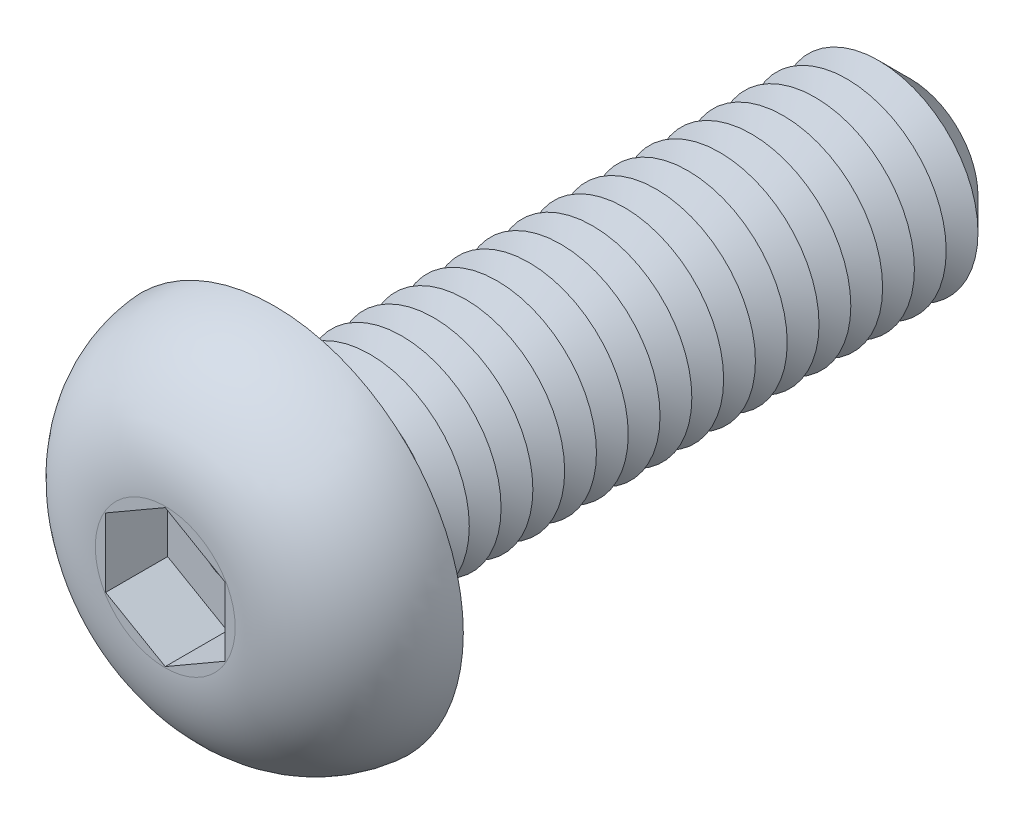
ISO-10303-21;
HEADER;
FILE_DESCRIPTION(('STEP AP214'),'2;1');
FILE_NAME('part.step','',(''),(''),'','','');
FILE_SCHEMA(('AUTOMOTIVE_DESIGN { 1 0 10303 214 1 1 1 1 }'));
ENDSEC;
DATA;
#1=APPLICATION_CONTEXT('core data for automotive mechanical design processes');
#2=APPLICATION_PROTOCOL_DEFINITION('international standard','automotive_design',2000,#1);
#3=PRODUCT_CONTEXT('',#1,'mechanical');
#4=PRODUCT('Part','Part','',(#3));
#5=PRODUCT_RELATED_PRODUCT_CATEGORY('part','',(#4));
#6=PRODUCT_DEFINITION_FORMATION('','',#4);
#7=PRODUCT_DEFINITION_CONTEXT('part definition',#1,'design');
#8=PRODUCT_DEFINITION('design','',#6,#7);
#9=PRODUCT_DEFINITION_SHAPE('','',#8);
#10=(LENGTH_UNIT() NAMED_UNIT(*) SI_UNIT(.MILLI.,.METRE.));
#11=(NAMED_UNIT(*) PLANE_ANGLE_UNIT() SI_UNIT($,.RADIAN.));
#12=(NAMED_UNIT(*) SI_UNIT($,.STERADIAN.) SOLID_ANGLE_UNIT());
#13=UNCERTAINTY_MEASURE_WITH_UNIT(LENGTH_MEASURE(1.E-05),#10,'distance_accuracy_value','');
#14=(GEOMETRIC_REPRESENTATION_CONTEXT(3) GLOBAL_UNCERTAINTY_ASSIGNED_CONTEXT((#13)) GLOBAL_UNIT_ASSIGNED_CONTEXT((#10,
#11,#12)) REPRESENTATION_CONTEXT('',''));
#15=CARTESIAN_POINT('',(0.,0.,0.));
#16=DIRECTION('',(0.,0.,1.));
#17=DIRECTION('',(1.,0.,0.));
#18=AXIS2_PLACEMENT_3D('',#15,#16,#17);
#19=CARTESIAN_POINT('',(0.,0.,-16.));
#20=DIRECTION('',(0.,0.,1.));
#21=DIRECTION('',(1.,0.,0.));
#22=AXIS2_PLACEMENT_3D('',#19,#20,#21);
#23=CYLINDRICAL_SURFACE('',#22,2.5);
#24=CARTESIAN_POINT('',(0.,0.,-0.399999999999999));
#25=DIRECTION('',(0.,0.,1.));
#26=DIRECTION('',(1.,0.,0.));
#27=AXIS2_PLACEMENT_3D('',#24,#25,#26);
#28=CIRCLE('',#27,2.5);
#29=CARTESIAN_POINT('',(2.5,0.,-0.399999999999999));
#30=VERTEX_POINT('',#29);
#31=EDGE_CURVE('E48',#30,#30,#28,.F.);
#32=ORIENTED_EDGE('',*,*,#31,.T.);
#33=EDGE_LOOP('',(#32));
#34=FACE_BOUND('',#33,.T.);
#35=CARTESIAN_POINT('',(0.,0.,-0.800000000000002));
#36=DIRECTION('',(0.,0.,1.));
#37=DIRECTION('',(1.,0.,0.));
#38=AXIS2_PLACEMENT_3D('',#35,#36,#37);
#39=CIRCLE('',#38,2.5);
#40=CARTESIAN_POINT('',(2.5,0.,-0.800000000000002));
#41=VERTEX_POINT('',#40);
#42=EDGE_CURVE('E138',#41,#41,#39,.T.);
#43=ORIENTED_EDGE('',*,*,#42,.T.);
#44=EDGE_LOOP('',(#43));
#45=FACE_BOUND('',#44,.T.);
#46=ADVANCED_FACE('F39',(#34,#45),#23,.T.);
#47=CARTESIAN_POINT('',(0.,4.75,0.));
#48=DIRECTION('',(0.,0.,1.));
#49=DIRECTION('',(1.,0.,0.));
#50=AXIS2_PLACEMENT_3D('',#47,#48,#49);
#51=PLANE('',#50);
#52=CARTESIAN_POINT('',(0.,0.,0.));
#53=DIRECTION('',(0.,0.,1.));
#54=DIRECTION('',(1.,0.,0.));
#55=AXIS2_PLACEMENT_3D('',#52,#53,#54);
#56=CIRCLE('',#55,2.9);
#57=CARTESIAN_POINT('',(2.9,0.,0.));
#58=VERTEX_POINT('',#57);
#59=EDGE_CURVE('E11',#58,#58,#56,.T.);
#60=ORIENTED_EDGE('',*,*,#59,.T.);
#61=EDGE_LOOP('',(#60));
#62=FACE_BOUND('',#61,.T.);
#63=CARTESIAN_POINT('',(0.,0.,0.));
#64=DIRECTION('',(0.,0.,1.));
#65=DIRECTION('',(1.,0.,0.));
#66=AXIS2_PLACEMENT_3D('',#63,#64,#65);
#67=CIRCLE('',#66,4.75);
#68=CARTESIAN_POINT('',(4.75,0.,0.));
#69=VERTEX_POINT('',#68);
#70=EDGE_CURVE('E157',#69,#69,#67,.T.);
#71=ORIENTED_EDGE('',*,*,#70,.F.);
#72=EDGE_LOOP('',(#71));
#73=FACE_BOUND('',#72,.T.);
#74=ADVANCED_FACE('F199',(#62,#73),#51,.F.);
#75=CARTESIAN_POINT('',(0.,0.,2.75));
#76=DIRECTION('',(0.,0.,-1.));
#77=DIRECTION('',(-1.,0.,0.));
#78=AXIS2_PLACEMENT_3D('',#75,#76,#77);
#79=PLANE('',#78);
#80=DIRECTION('',(-0.866025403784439,-0.5,0.));
#81=VECTOR('',#80,1.);
#82=CARTESIAN_POINT('',(0.,1.73205080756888,2.75));
#83=LINE('',#82,#81);
#84=CARTESIAN_POINT('',(0.,1.73205080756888,2.75));
#85=VERTEX_POINT('',#84);
#86=CARTESIAN_POINT('',(-1.5,0.866025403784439,2.75));
#87=VERTEX_POINT('',#86);
#88=EDGE_CURVE('E137',#85,#87,#83,.T.);
#89=ORIENTED_EDGE('',*,*,#88,.F.);
#90=DIRECTION('',(-0.866025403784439,0.5,0.));
#91=VECTOR('',#90,1.);
#92=CARTESIAN_POINT('',(1.5,0.86602540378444,2.75));
#93=LINE('',#92,#91);
#94=CARTESIAN_POINT('',(1.5,0.86602540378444,2.75));
#95=VERTEX_POINT('',#94);
#96=EDGE_CURVE('E55',#95,#85,#93,.T.);
#97=ORIENTED_EDGE('',*,*,#96,.F.);
#98=DIRECTION('',(0.,1.,0.));
#99=VECTOR('',#98,1.);
#100=CARTESIAN_POINT('',(1.5,-0.866025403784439,2.75));
#101=LINE('',#100,#99);
#102=CARTESIAN_POINT('',(1.5,-0.866025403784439,2.75));
#103=VERTEX_POINT('',#102);
#104=EDGE_CURVE('E151',#103,#95,#101,.T.);
#105=ORIENTED_EDGE('',*,*,#104,.F.);
#106=DIRECTION('',(0.866025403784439,0.5,0.));
#107=VECTOR('',#106,1.);
#108=CARTESIAN_POINT('',(0.,-1.73205080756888,2.75));
#109=LINE('',#108,#107);
#110=CARTESIAN_POINT('',(0.,-1.73205080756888,2.75));
#111=VERTEX_POINT('',#110);
#112=EDGE_CURVE('E148',#111,#103,#109,.T.);
#113=ORIENTED_EDGE('',*,*,#112,.F.);
#114=DIRECTION('',(0.866025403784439,-0.5,0.));
#115=VECTOR('',#114,1.);
#116=CARTESIAN_POINT('',(-1.5,-0.866025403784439,2.75));
#117=LINE('',#116,#115);
#118=CARTESIAN_POINT('',(-1.5,-0.866025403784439,2.75));
#119=VERTEX_POINT('',#118);
#120=EDGE_CURVE('E103',#119,#111,#117,.T.);
#121=ORIENTED_EDGE('',*,*,#120,.F.);
#122=DIRECTION('',(0.,-1.,0.));
#123=VECTOR('',#122,1.);
#124=CARTESIAN_POINT('',(-1.5,0.866025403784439,2.75));
#125=LINE('',#124,#123);
#126=EDGE_CURVE('E142',#87,#119,#125,.T.);
#127=ORIENTED_EDGE('',*,*,#126,.F.);
#128=EDGE_LOOP('',(#89,#97,#105,#113,#121,#127));
#129=FACE_BOUND('',#128,.T.);
#130=CARTESIAN_POINT('',(0.,0.,2.75));
#131=DIRECTION('',(0.,0.,1.));
#132=DIRECTION('',(1.,0.,0.));
#133=AXIS2_PLACEMENT_3D('',#130,#131,#132);
#134=CIRCLE('',#133,1.76043481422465);
#135=CARTESIAN_POINT('',(1.76043481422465,0.,2.75));
#136=VERTEX_POINT('',#135);
#137=EDGE_CURVE('E170',#136,#136,#134,.T.);
#138=ORIENTED_EDGE('',*,*,#137,.T.);
#139=EDGE_LOOP('',(#138));
#140=FACE_BOUND('',#139,.T.);
#141=ADVANCED_FACE('F204',(#129,#140),#79,.F.);
#142=CARTESIAN_POINT('',(0.,0.,-0.25));
#143=DIRECTION('',(0.,0.,1.));
#144=DIRECTION('',(1.,0.,0.));
#145=AXIS2_PLACEMENT_3D('',#142,#143,#144);
#146=DEGENERATE_TOROIDAL_SURFACE('',#145,1.76043481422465,3.,.T.);
#147=ORIENTED_EDGE('',*,*,#137,.F.);
#148=EDGE_LOOP('',(#147));
#149=FACE_BOUND('',#148,.T.);
#150=ORIENTED_EDGE('',*,*,#70,.T.);
#151=EDGE_LOOP('',(#150));
#152=FACE_BOUND('',#151,.T.);
#153=ADVANCED_FACE('F232',(#149,#152),#146,.T.);
#154=CARTESIAN_POINT('',(1.5,0.86602540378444,1.19));
#155=DIRECTION('',(0.5,0.866025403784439,0.));
#156=DIRECTION('',(-0.866025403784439,0.5,0.));
#157=AXIS2_PLACEMENT_3D('',#154,#155,#156);
#158=PLANE('',#157);
#159=ORIENTED_EDGE('',*,*,#96,.T.);
#160=DIRECTION('',(0.,0.,1.));
#161=VECTOR('',#160,1.);
#162=CARTESIAN_POINT('',(0.,1.73205080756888,1.19));
#163=LINE('',#162,#161);
#164=CARTESIAN_POINT('',(0.,1.73205080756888,1.19));
#165=VERTEX_POINT('',#164);
#166=EDGE_CURVE('E85',#165,#85,#163,.T.);
#167=ORIENTED_EDGE('',*,*,#166,.F.);
#168=DIRECTION('',(-0.866025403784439,0.5,0.));
#169=VECTOR('',#168,1.);
#170=CARTESIAN_POINT('',(1.5,0.86602540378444,1.19));
#171=LINE('',#170,#169);
#172=CARTESIAN_POINT('',(1.5,0.86602540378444,1.19));
#173=VERTEX_POINT('',#172);
#174=EDGE_CURVE('E154',#173,#165,#171,.T.);
#175=ORIENTED_EDGE('',*,*,#174,.F.);
#176=DIRECTION('',(0.,0.,1.));
#177=VECTOR('',#176,1.);
#178=CARTESIAN_POINT('',(1.5,0.86602540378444,1.19));
#179=LINE('',#178,#177);
#180=EDGE_CURVE('E63',#173,#95,#179,.T.);
#181=ORIENTED_EDGE('',*,*,#180,.T.);
#182=EDGE_LOOP('',(#159,#167,#175,#181));
#183=FACE_BOUND('',#182,.T.);
#184=ADVANCED_FACE('F218',(#183),#158,.F.);
#185=CARTESIAN_POINT('',(1.5,-0.866025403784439,1.19));
#186=DIRECTION('',(1.,0.,0.));
#187=DIRECTION('',(0.,1.,0.));
#188=AXIS2_PLACEMENT_3D('',#185,#186,#187);
#189=PLANE('',#188);
#190=ORIENTED_EDGE('',*,*,#104,.T.);
#191=ORIENTED_EDGE('',*,*,#180,.F.);
#192=DIRECTION('',(0.,1.,0.));
#193=VECTOR('',#192,1.);
#194=CARTESIAN_POINT('',(1.5,-0.866025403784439,1.19));
#195=LINE('',#194,#193);
#196=CARTESIAN_POINT('',(1.5,-0.866025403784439,1.19));
#197=VERTEX_POINT('',#196);
#198=EDGE_CURVE('E117',#197,#173,#195,.T.);
#199=ORIENTED_EDGE('',*,*,#198,.F.);
#200=DIRECTION('',(0.,0.,1.));
#201=VECTOR('',#200,1.);
#202=CARTESIAN_POINT('',(1.5,-0.866025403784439,1.19));
#203=LINE('',#202,#201);
#204=EDGE_CURVE('E108',#197,#103,#203,.T.);
#205=ORIENTED_EDGE('',*,*,#204,.T.);
#206=EDGE_LOOP('',(#190,#191,#199,#205));
#207=FACE_BOUND('',#206,.T.);
#208=ADVANCED_FACE('F215',(#207),#189,.F.);
#209=CARTESIAN_POINT('',(0.,-1.73205080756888,1.19));
#210=DIRECTION('',(0.5,-0.866025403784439,0.));
#211=DIRECTION('',(0.866025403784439,0.5,0.));
#212=AXIS2_PLACEMENT_3D('',#209,#210,#211);
#213=PLANE('',#212);
#214=ORIENTED_EDGE('',*,*,#112,.T.);
#215=ORIENTED_EDGE('',*,*,#204,.F.);
#216=DIRECTION('',(0.866025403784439,0.5,0.));
#217=VECTOR('',#216,1.);
#218=CARTESIAN_POINT('',(0.,-1.73205080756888,1.19));
#219=LINE('',#218,#217);
#220=CARTESIAN_POINT('',(0.,-1.73205080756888,1.19));
#221=VERTEX_POINT('',#220);
#222=EDGE_CURVE('E112',#221,#197,#219,.T.);
#223=ORIENTED_EDGE('',*,*,#222,.F.);
#224=DIRECTION('',(0.,0.,1.));
#225=VECTOR('',#224,1.);
#226=CARTESIAN_POINT('',(0.,-1.73205080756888,1.19));
#227=LINE('',#226,#225);
#228=EDGE_CURVE('E96',#221,#111,#227,.T.);
#229=ORIENTED_EDGE('',*,*,#228,.T.);
#230=EDGE_LOOP('',(#214,#215,#223,#229));
#231=FACE_BOUND('',#230,.T.);
#232=ADVANCED_FACE('F113',(#231),#213,.F.);
#233=CARTESIAN_POINT('',(-1.5,-0.866025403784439,1.19));
#234=DIRECTION('',(-0.5,-0.866025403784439,0.));
#235=DIRECTION('',(0.866025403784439,-0.5,0.));
#236=AXIS2_PLACEMENT_3D('',#233,#234,#235);
#237=PLANE('',#236);
#238=ORIENTED_EDGE('',*,*,#120,.T.);
#239=ORIENTED_EDGE('',*,*,#228,.F.);
#240=DIRECTION('',(0.866025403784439,-0.5,0.));
#241=VECTOR('',#240,1.);
#242=CARTESIAN_POINT('',(-1.5,-0.866025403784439,1.19));
#243=LINE('',#242,#241);
#244=CARTESIAN_POINT('',(-1.5,-0.866025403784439,1.19));
#245=VERTEX_POINT('',#244);
#246=EDGE_CURVE('E100',#245,#221,#243,.T.);
#247=ORIENTED_EDGE('',*,*,#246,.F.);
#248=DIRECTION('',(0.,0.,1.));
#249=VECTOR('',#248,1.);
#250=CARTESIAN_POINT('',(-1.5,-0.866025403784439,1.19));
#251=LINE('',#250,#249);
#252=EDGE_CURVE('E109',#245,#119,#251,.T.);
#253=ORIENTED_EDGE('',*,*,#252,.T.);
#254=EDGE_LOOP('',(#238,#239,#247,#253));
#255=FACE_BOUND('',#254,.T.);
#256=ADVANCED_FACE('F98',(#255),#237,.F.);
#257=CARTESIAN_POINT('',(-1.5,0.866025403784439,1.19));
#258=DIRECTION('',(-1.,0.,0.));
#259=DIRECTION('',(0.,-1.,0.));
#260=AXIS2_PLACEMENT_3D('',#257,#258,#259);
#261=PLANE('',#260);
#262=ORIENTED_EDGE('',*,*,#126,.T.);
#263=ORIENTED_EDGE('',*,*,#252,.F.);
#264=DIRECTION('',(0.,-1.,0.));
#265=VECTOR('',#264,1.);
#266=CARTESIAN_POINT('',(-1.5,0.866025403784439,1.19));
#267=LINE('',#266,#265);
#268=CARTESIAN_POINT('',(-1.5,0.866025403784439,1.19));
#269=VERTEX_POINT('',#268);
#270=EDGE_CURVE('E123',#269,#245,#267,.T.);
#271=ORIENTED_EDGE('',*,*,#270,.F.);
#272=DIRECTION('',(0.,0.,1.));
#273=VECTOR('',#272,1.);
#274=CARTESIAN_POINT('',(-1.5,0.866025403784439,1.19));
#275=LINE('',#274,#273);
#276=EDGE_CURVE('E162',#269,#87,#275,.T.);
#277=ORIENTED_EDGE('',*,*,#276,.T.);
#278=EDGE_LOOP('',(#262,#263,#271,#277));
#279=FACE_BOUND('',#278,.T.);
#280=ADVANCED_FACE('F223',(#279),#261,.F.);
#281=CARTESIAN_POINT('',(0.,1.73205080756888,1.19));
#282=DIRECTION('',(-0.5,0.866025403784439,0.));
#283=DIRECTION('',(-0.866025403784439,-0.5,0.));
#284=AXIS2_PLACEMENT_3D('',#281,#282,#283);
#285=PLANE('',#284);
#286=ORIENTED_EDGE('',*,*,#88,.T.);
#287=ORIENTED_EDGE('',*,*,#276,.F.);
#288=DIRECTION('',(-0.866025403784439,-0.5,0.));
#289=VECTOR('',#288,1.);
#290=CARTESIAN_POINT('',(0.,1.73205080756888,1.19));
#291=LINE('',#290,#289);
#292=EDGE_CURVE('E129',#165,#269,#291,.T.);
#293=ORIENTED_EDGE('',*,*,#292,.F.);
#294=ORIENTED_EDGE('',*,*,#166,.T.);
#295=EDGE_LOOP('',(#286,#287,#293,#294));
#296=FACE_BOUND('',#295,.T.);
#297=ADVANCED_FACE('F213',(#296),#285,.F.);
#298=CARTESIAN_POINT('',(0.,0.,1.19));
#299=DIRECTION('',(0.,0.,1.));
#300=DIRECTION('',(1.,0.,0.));
#301=AXIS2_PLACEMENT_3D('',#298,#299,#300);
#302=PLANE('',#301);
#303=CARTESIAN_POINT('',(0.,0.,1.19));
#304=DIRECTION('',(0.,0.,1.));
#305=DIRECTION('',(1.,0.,0.));
#306=AXIS2_PLACEMENT_3D('',#303,#304,#305);
#307=CIRCLE('',#306,0.65);
#308=CARTESIAN_POINT('',(0.65,0.,1.19));
#309=VERTEX_POINT('',#308);
#310=EDGE_CURVE('E399',#309,#309,#307,.T.);
#311=ORIENTED_EDGE('',*,*,#310,.F.);
#312=EDGE_LOOP('',(#311));
#313=FACE_BOUND('',#312,.T.);
#314=ORIENTED_EDGE('',*,*,#174,.T.);
#315=ORIENTED_EDGE('',*,*,#292,.T.);
#316=ORIENTED_EDGE('',*,*,#270,.T.);
#317=ORIENTED_EDGE('',*,*,#246,.T.);
#318=ORIENTED_EDGE('',*,*,#222,.T.);
#319=ORIENTED_EDGE('',*,*,#198,.T.);
#320=EDGE_LOOP('',(#314,#315,#316,#317,#318,#319));
#321=FACE_BOUND('',#320,.T.);
#322=ADVANCED_FACE('F120',(#313,#321),#302,.T.);
#323=CARTESIAN_POINT('',(0.,0.,-0.800000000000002));
#324=DIRECTION('',(0.,0.,1.));
#325=DIRECTION('',(1.,0.,0.));
#326=AXIS2_PLACEMENT_3D('',#323,#324,#325);
#327=CONICAL_SURFACE('',#326,2.5,1.0471975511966);
#328=CARTESIAN_POINT('',(0.,0.,-1.2));
#329=DIRECTION('',(0.,0.,1.));
#330=DIRECTION('',(1.,0.,0.));
#331=AXIS2_PLACEMENT_3D('',#328,#329,#330);
#332=CIRCLE('',#331,1.80717967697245);
#333=CARTESIAN_POINT('',(1.80717967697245,0.,-1.2));
#334=VERTEX_POINT('',#333);
#335=EDGE_CURVE('E255',#334,#334,#332,.T.);
#336=ORIENTED_EDGE('',*,*,#335,.T.);
#337=EDGE_LOOP('',(#336));
#338=FACE_BOUND('',#337,.T.);
#339=ORIENTED_EDGE('',*,*,#42,.F.);
#340=EDGE_LOOP('',(#339));
#341=FACE_BOUND('',#340,.T.);
#342=ADVANCED_FACE('F212',(#338,#341),#327,.T.);
#343=CARTESIAN_POINT('',(0.,0.,-1.2));
#344=DIRECTION('',(0.,0.,-1.));
#345=DIRECTION('',(-1.,0.,0.));
#346=AXIS2_PLACEMENT_3D('',#343,#344,#345);
#347=CONICAL_SURFACE('',#346,1.80717967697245,1.0471975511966);
#348=CARTESIAN_POINT('',(0.,0.,-1.6));
#349=DIRECTION('',(0.,0.,1.));
#350=DIRECTION('',(1.,0.,0.));
#351=AXIS2_PLACEMENT_3D('',#348,#349,#350);
#352=CIRCLE('',#351,2.5);
#353=CARTESIAN_POINT('',(2.5,0.,-1.6));
#354=VERTEX_POINT('',#353);
#355=EDGE_CURVE('E258',#354,#354,#352,.T.);
#356=ORIENTED_EDGE('',*,*,#355,.T.);
#357=EDGE_LOOP('',(#356));
#358=FACE_BOUND('',#357,.T.);
#359=ORIENTED_EDGE('',*,*,#335,.F.);
#360=EDGE_LOOP('',(#359));
#361=FACE_BOUND('',#360,.T.);
#362=ADVANCED_FACE('F551',(#358,#361),#347,.T.);
#363=CARTESIAN_POINT('',(0.,0.,-1.6));
#364=DIRECTION('',(0.,0.,1.));
#365=DIRECTION('',(1.,0.,0.));
#366=AXIS2_PLACEMENT_3D('',#363,#364,#365);
#367=CONICAL_SURFACE('',#366,2.5,1.0471975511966);
#368=CARTESIAN_POINT('',(0.,0.,-2.));
#369=DIRECTION('',(0.,0.,1.));
#370=DIRECTION('',(1.,0.,0.));
#371=AXIS2_PLACEMENT_3D('',#368,#369,#370);
#372=CIRCLE('',#371,1.80717967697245);
#373=CARTESIAN_POINT('',(1.80717967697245,0.,-2.));
#374=VERTEX_POINT('',#373);
#375=EDGE_CURVE('E262',#374,#374,#372,.T.);
#376=ORIENTED_EDGE('',*,*,#375,.T.);
#377=EDGE_LOOP('',(#376));
#378=FACE_BOUND('',#377,.T.);
#379=ORIENTED_EDGE('',*,*,#355,.F.);
#380=EDGE_LOOP('',(#379));
#381=FACE_BOUND('',#380,.T.);
#382=ADVANCED_FACE('F547',(#378,#381),#367,.T.);
#383=CARTESIAN_POINT('',(0.,0.,-2.));
#384=DIRECTION('',(0.,0.,-1.));
#385=DIRECTION('',(-1.,0.,0.));
#386=AXIS2_PLACEMENT_3D('',#383,#384,#385);
#387=CONICAL_SURFACE('',#386,1.80717967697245,1.0471975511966);
#388=CARTESIAN_POINT('',(0.,0.,-2.4));
#389=DIRECTION('',(0.,0.,1.));
#390=DIRECTION('',(1.,0.,0.));
#391=AXIS2_PLACEMENT_3D('',#388,#389,#390);
#392=CIRCLE('',#391,2.5);
#393=CARTESIAN_POINT('',(2.5,0.,-2.4));
#394=VERTEX_POINT('',#393);
#395=EDGE_CURVE('E266',#394,#394,#392,.T.);
#396=ORIENTED_EDGE('',*,*,#395,.T.);
#397=EDGE_LOOP('',(#396));
#398=FACE_BOUND('',#397,.T.);
#399=ORIENTED_EDGE('',*,*,#375,.F.);
#400=EDGE_LOOP('',(#399));
#401=FACE_BOUND('',#400,.T.);
#402=ADVANCED_FACE('F543',(#398,#401),#387,.T.);
#403=CARTESIAN_POINT('',(0.,0.,-2.4));
#404=DIRECTION('',(0.,0.,1.));
#405=DIRECTION('',(1.,0.,0.));
#406=AXIS2_PLACEMENT_3D('',#403,#404,#405);
#407=CONICAL_SURFACE('',#406,2.5,1.0471975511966);
#408=CARTESIAN_POINT('',(0.,0.,-2.8));
#409=DIRECTION('',(0.,0.,1.));
#410=DIRECTION('',(1.,0.,0.));
#411=AXIS2_PLACEMENT_3D('',#408,#409,#410);
#412=CIRCLE('',#411,1.80717967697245);
#413=CARTESIAN_POINT('',(1.80717967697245,0.,-2.8));
#414=VERTEX_POINT('',#413);
#415=EDGE_CURVE('E269',#414,#414,#412,.T.);
#416=ORIENTED_EDGE('',*,*,#415,.T.);
#417=EDGE_LOOP('',(#416));
#418=FACE_BOUND('',#417,.T.);
#419=ORIENTED_EDGE('',*,*,#395,.F.);
#420=EDGE_LOOP('',(#419));
#421=FACE_BOUND('',#420,.T.);
#422=ADVANCED_FACE('F539',(#418,#421),#407,.T.);
#423=CARTESIAN_POINT('',(0.,0.,-2.8));
#424=DIRECTION('',(0.,0.,-1.));
#425=DIRECTION('',(-1.,0.,0.));
#426=AXIS2_PLACEMENT_3D('',#423,#424,#425);
#427=CONICAL_SURFACE('',#426,1.80717967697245,1.0471975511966);
#428=CARTESIAN_POINT('',(0.,0.,-3.2));
#429=DIRECTION('',(0.,0.,1.));
#430=DIRECTION('',(1.,0.,0.));
#431=AXIS2_PLACEMENT_3D('',#428,#429,#430);
#432=CIRCLE('',#431,2.5);
#433=CARTESIAN_POINT('',(2.5,0.,-3.2));
#434=VERTEX_POINT('',#433);
#435=EDGE_CURVE('E273',#434,#434,#432,.T.);
#436=ORIENTED_EDGE('',*,*,#435,.T.);
#437=EDGE_LOOP('',(#436));
#438=FACE_BOUND('',#437,.T.);
#439=ORIENTED_EDGE('',*,*,#415,.F.);
#440=EDGE_LOOP('',(#439));
#441=FACE_BOUND('',#440,.T.);
#442=ADVANCED_FACE('F535',(#438,#441),#427,.T.);
#443=CARTESIAN_POINT('',(0.,0.,-3.2));
#444=DIRECTION('',(0.,0.,1.));
#445=DIRECTION('',(1.,0.,0.));
#446=AXIS2_PLACEMENT_3D('',#443,#444,#445);
#447=CONICAL_SURFACE('',#446,2.5,1.0471975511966);
#448=CARTESIAN_POINT('',(0.,0.,-3.6));
#449=DIRECTION('',(0.,0.,1.));
#450=DIRECTION('',(1.,0.,0.));
#451=AXIS2_PLACEMENT_3D('',#448,#449,#450);
#452=CIRCLE('',#451,1.80717967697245);
#453=CARTESIAN_POINT('',(1.80717967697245,0.,-3.6));
#454=VERTEX_POINT('',#453);
#455=EDGE_CURVE('E277',#454,#454,#452,.T.);
#456=ORIENTED_EDGE('',*,*,#455,.T.);
#457=EDGE_LOOP('',(#456));
#458=FACE_BOUND('',#457,.T.);
#459=ORIENTED_EDGE('',*,*,#435,.F.);
#460=EDGE_LOOP('',(#459));
#461=FACE_BOUND('',#460,.T.);
#462=ADVANCED_FACE('F531',(#458,#461),#447,.T.);
#463=CARTESIAN_POINT('',(0.,0.,-3.6));
#464=DIRECTION('',(0.,0.,-1.));
#465=DIRECTION('',(-1.,0.,0.));
#466=AXIS2_PLACEMENT_3D('',#463,#464,#465);
#467=CONICAL_SURFACE('',#466,1.80717967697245,1.0471975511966);
#468=CARTESIAN_POINT('',(0.,0.,-4.));
#469=DIRECTION('',(0.,0.,1.));
#470=DIRECTION('',(1.,0.,0.));
#471=AXIS2_PLACEMENT_3D('',#468,#469,#470);
#472=CIRCLE('',#471,2.5);
#473=CARTESIAN_POINT('',(2.5,0.,-4.));
#474=VERTEX_POINT('',#473);
#475=EDGE_CURVE('E281',#474,#474,#472,.T.);
#476=ORIENTED_EDGE('',*,*,#475,.T.);
#477=EDGE_LOOP('',(#476));
#478=FACE_BOUND('',#477,.T.);
#479=ORIENTED_EDGE('',*,*,#455,.F.);
#480=EDGE_LOOP('',(#479));
#481=FACE_BOUND('',#480,.T.);
#482=ADVANCED_FACE('F527',(#478,#481),#467,.T.);
#483=CARTESIAN_POINT('',(0.,0.,-4.));
#484=DIRECTION('',(0.,0.,1.));
#485=DIRECTION('',(1.,0.,0.));
#486=AXIS2_PLACEMENT_3D('',#483,#484,#485);
#487=CONICAL_SURFACE('',#486,2.5,1.0471975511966);
#488=CARTESIAN_POINT('',(0.,0.,-4.4));
#489=DIRECTION('',(0.,0.,1.));
#490=DIRECTION('',(1.,0.,0.));
#491=AXIS2_PLACEMENT_3D('',#488,#489,#490);
#492=CIRCLE('',#491,1.80717967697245);
#493=CARTESIAN_POINT('',(1.80717967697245,0.,-4.4));
#494=VERTEX_POINT('',#493);
#495=EDGE_CURVE('E285',#494,#494,#492,.T.);
#496=ORIENTED_EDGE('',*,*,#495,.T.);
#497=EDGE_LOOP('',(#496));
#498=FACE_BOUND('',#497,.T.);
#499=ORIENTED_EDGE('',*,*,#475,.F.);
#500=EDGE_LOOP('',(#499));
#501=FACE_BOUND('',#500,.T.);
#502=ADVANCED_FACE('F523',(#498,#501),#487,.T.);
#503=CARTESIAN_POINT('',(0.,0.,-4.4));
#504=DIRECTION('',(0.,0.,-1.));
#505=DIRECTION('',(-1.,0.,0.));
#506=AXIS2_PLACEMENT_3D('',#503,#504,#505);
#507=CONICAL_SURFACE('',#506,1.80717967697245,1.0471975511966);
#508=CARTESIAN_POINT('',(0.,0.,-4.8));
#509=DIRECTION('',(0.,0.,1.));
#510=DIRECTION('',(1.,0.,0.));
#511=AXIS2_PLACEMENT_3D('',#508,#509,#510);
#512=CIRCLE('',#511,2.5);
#513=CARTESIAN_POINT('',(2.5,0.,-4.8));
#514=VERTEX_POINT('',#513);
#515=EDGE_CURVE('E289',#514,#514,#512,.T.);
#516=ORIENTED_EDGE('',*,*,#515,.T.);
#517=EDGE_LOOP('',(#516));
#518=FACE_BOUND('',#517,.T.);
#519=ORIENTED_EDGE('',*,*,#495,.F.);
#520=EDGE_LOOP('',(#519));
#521=FACE_BOUND('',#520,.T.);
#522=ADVANCED_FACE('F519',(#518,#521),#507,.T.);
#523=CARTESIAN_POINT('',(0.,0.,-4.8));
#524=DIRECTION('',(0.,0.,1.));
#525=DIRECTION('',(1.,0.,0.));
#526=AXIS2_PLACEMENT_3D('',#523,#524,#525);
#527=CONICAL_SURFACE('',#526,2.5,1.0471975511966);
#528=CARTESIAN_POINT('',(0.,0.,-5.2));
#529=DIRECTION('',(0.,0.,1.));
#530=DIRECTION('',(1.,0.,0.));
#531=AXIS2_PLACEMENT_3D('',#528,#529,#530);
#532=CIRCLE('',#531,1.80717967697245);
#533=CARTESIAN_POINT('',(1.80717967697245,0.,-5.2));
#534=VERTEX_POINT('',#533);
#535=EDGE_CURVE('E293',#534,#534,#532,.T.);
#536=ORIENTED_EDGE('',*,*,#535,.T.);
#537=EDGE_LOOP('',(#536));
#538=FACE_BOUND('',#537,.T.);
#539=ORIENTED_EDGE('',*,*,#515,.F.);
#540=EDGE_LOOP('',(#539));
#541=FACE_BOUND('',#540,.T.);
#542=ADVANCED_FACE('F515',(#538,#541),#527,.T.);
#543=CARTESIAN_POINT('',(0.,0.,-5.2));
#544=DIRECTION('',(0.,0.,-1.));
#545=DIRECTION('',(-1.,0.,0.));
#546=AXIS2_PLACEMENT_3D('',#543,#544,#545);
#547=CONICAL_SURFACE('',#546,1.80717967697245,1.0471975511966);
#548=CARTESIAN_POINT('',(0.,0.,-5.6));
#549=DIRECTION('',(0.,0.,1.));
#550=DIRECTION('',(1.,0.,0.));
#551=AXIS2_PLACEMENT_3D('',#548,#549,#550);
#552=CIRCLE('',#551,2.5);
#553=CARTESIAN_POINT('',(2.5,0.,-5.6));
#554=VERTEX_POINT('',#553);
#555=EDGE_CURVE('E297',#554,#554,#552,.T.);
#556=ORIENTED_EDGE('',*,*,#555,.T.);
#557=EDGE_LOOP('',(#556));
#558=FACE_BOUND('',#557,.T.);
#559=ORIENTED_EDGE('',*,*,#535,.F.);
#560=EDGE_LOOP('',(#559));
#561=FACE_BOUND('',#560,.T.);
#562=ADVANCED_FACE('F511',(#558,#561),#547,.T.);
#563=CARTESIAN_POINT('',(0.,0.,-5.6));
#564=DIRECTION('',(0.,0.,1.));
#565=DIRECTION('',(1.,0.,0.));
#566=AXIS2_PLACEMENT_3D('',#563,#564,#565);
#567=CONICAL_SURFACE('',#566,2.5,1.0471975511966);
#568=CARTESIAN_POINT('',(0.,0.,-6.));
#569=DIRECTION('',(0.,0.,1.));
#570=DIRECTION('',(1.,0.,0.));
#571=AXIS2_PLACEMENT_3D('',#568,#569,#570);
#572=CIRCLE('',#571,1.80717967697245);
#573=CARTESIAN_POINT('',(1.80717967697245,0.,-6.));
#574=VERTEX_POINT('',#573);
#575=EDGE_CURVE('E301',#574,#574,#572,.T.);
#576=ORIENTED_EDGE('',*,*,#575,.T.);
#577=EDGE_LOOP('',(#576));
#578=FACE_BOUND('',#577,.T.);
#579=ORIENTED_EDGE('',*,*,#555,.F.);
#580=EDGE_LOOP('',(#579));
#581=FACE_BOUND('',#580,.T.);
#582=ADVANCED_FACE('F507',(#578,#581),#567,.T.);
#583=CARTESIAN_POINT('',(0.,0.,-6.));
#584=DIRECTION('',(0.,0.,-1.));
#585=DIRECTION('',(-1.,0.,0.));
#586=AXIS2_PLACEMENT_3D('',#583,#584,#585);
#587=CONICAL_SURFACE('',#586,1.80717967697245,1.0471975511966);
#588=CARTESIAN_POINT('',(0.,0.,-6.4));
#589=DIRECTION('',(0.,0.,1.));
#590=DIRECTION('',(1.,0.,0.));
#591=AXIS2_PLACEMENT_3D('',#588,#589,#590);
#592=CIRCLE('',#591,2.5);
#593=CARTESIAN_POINT('',(2.5,0.,-6.4));
#594=VERTEX_POINT('',#593);
#595=EDGE_CURVE('E304',#594,#594,#592,.T.);
#596=ORIENTED_EDGE('',*,*,#595,.T.);
#597=EDGE_LOOP('',(#596));
#598=FACE_BOUND('',#597,.T.);
#599=ORIENTED_EDGE('',*,*,#575,.F.);
#600=EDGE_LOOP('',(#599));
#601=FACE_BOUND('',#600,.T.);
#602=ADVANCED_FACE('F503',(#598,#601),#587,.T.);
#603=CARTESIAN_POINT('',(0.,0.,-6.4));
#604=DIRECTION('',(0.,0.,1.));
#605=DIRECTION('',(1.,0.,0.));
#606=AXIS2_PLACEMENT_3D('',#603,#604,#605);
#607=CONICAL_SURFACE('',#606,2.5,1.0471975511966);
#608=CARTESIAN_POINT('',(0.,0.,-6.8));
#609=DIRECTION('',(0.,0.,1.));
#610=DIRECTION('',(1.,0.,0.));
#611=AXIS2_PLACEMENT_3D('',#608,#609,#610);
#612=CIRCLE('',#611,1.80717967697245);
#613=CARTESIAN_POINT('',(1.80717967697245,0.,-6.8));
#614=VERTEX_POINT('',#613);
#615=EDGE_CURVE('E308',#614,#614,#612,.T.);
#616=ORIENTED_EDGE('',*,*,#615,.T.);
#617=EDGE_LOOP('',(#616));
#618=FACE_BOUND('',#617,.T.);
#619=ORIENTED_EDGE('',*,*,#595,.F.);
#620=EDGE_LOOP('',(#619));
#621=FACE_BOUND('',#620,.T.);
#622=ADVANCED_FACE('F499',(#618,#621),#607,.T.);
#623=CARTESIAN_POINT('',(0.,0.,-6.8));
#624=DIRECTION('',(0.,0.,-1.));
#625=DIRECTION('',(-1.,0.,0.));
#626=AXIS2_PLACEMENT_3D('',#623,#624,#625);
#627=CONICAL_SURFACE('',#626,1.80717967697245,1.0471975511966);
#628=CARTESIAN_POINT('',(0.,0.,-7.2));
#629=DIRECTION('',(0.,0.,1.));
#630=DIRECTION('',(1.,0.,0.));
#631=AXIS2_PLACEMENT_3D('',#628,#629,#630);
#632=CIRCLE('',#631,2.5);
#633=CARTESIAN_POINT('',(2.5,0.,-7.2));
#634=VERTEX_POINT('',#633);
#635=EDGE_CURVE('E312',#634,#634,#632,.T.);
#636=ORIENTED_EDGE('',*,*,#635,.T.);
#637=EDGE_LOOP('',(#636));
#638=FACE_BOUND('',#637,.T.);
#639=ORIENTED_EDGE('',*,*,#615,.F.);
#640=EDGE_LOOP('',(#639));
#641=FACE_BOUND('',#640,.T.);
#642=ADVANCED_FACE('F495',(#638,#641),#627,.T.);
#643=CARTESIAN_POINT('',(0.,0.,-7.2));
#644=DIRECTION('',(0.,0.,1.));
#645=DIRECTION('',(1.,0.,0.));
#646=AXIS2_PLACEMENT_3D('',#643,#644,#645);
#647=CONICAL_SURFACE('',#646,2.5,1.0471975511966);
#648=CARTESIAN_POINT('',(0.,0.,-7.6));
#649=DIRECTION('',(0.,0.,1.));
#650=DIRECTION('',(1.,0.,0.));
#651=AXIS2_PLACEMENT_3D('',#648,#649,#650);
#652=CIRCLE('',#651,1.80717967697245);
#653=CARTESIAN_POINT('',(1.80717967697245,0.,-7.6));
#654=VERTEX_POINT('',#653);
#655=EDGE_CURVE('E316',#654,#654,#652,.T.);
#656=ORIENTED_EDGE('',*,*,#655,.T.);
#657=EDGE_LOOP('',(#656));
#658=FACE_BOUND('',#657,.T.);
#659=ORIENTED_EDGE('',*,*,#635,.F.);
#660=EDGE_LOOP('',(#659));
#661=FACE_BOUND('',#660,.T.);
#662=ADVANCED_FACE('F491',(#658,#661),#647,.T.);
#663=CARTESIAN_POINT('',(0.,0.,-7.6));
#664=DIRECTION('',(0.,0.,-1.));
#665=DIRECTION('',(-1.,0.,0.));
#666=AXIS2_PLACEMENT_3D('',#663,#664,#665);
#667=CONICAL_SURFACE('',#666,1.80717967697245,1.0471975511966);
#668=CARTESIAN_POINT('',(0.,0.,-8.));
#669=DIRECTION('',(0.,0.,1.));
#670=DIRECTION('',(1.,0.,0.));
#671=AXIS2_PLACEMENT_3D('',#668,#669,#670);
#672=CIRCLE('',#671,2.5);
#673=CARTESIAN_POINT('',(2.5,0.,-8.));
#674=VERTEX_POINT('',#673);
#675=EDGE_CURVE('E320',#674,#674,#672,.T.);
#676=ORIENTED_EDGE('',*,*,#675,.T.);
#677=EDGE_LOOP('',(#676));
#678=FACE_BOUND('',#677,.T.);
#679=ORIENTED_EDGE('',*,*,#655,.F.);
#680=EDGE_LOOP('',(#679));
#681=FACE_BOUND('',#680,.T.);
#682=ADVANCED_FACE('F487',(#678,#681),#667,.T.);
#683=CARTESIAN_POINT('',(0.,0.,-8.));
#684=DIRECTION('',(0.,0.,1.));
#685=DIRECTION('',(1.,0.,0.));
#686=AXIS2_PLACEMENT_3D('',#683,#684,#685);
#687=CONICAL_SURFACE('',#686,2.5,1.0471975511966);
#688=CARTESIAN_POINT('',(0.,0.,-8.4));
#689=DIRECTION('',(0.,0.,1.));
#690=DIRECTION('',(1.,0.,0.));
#691=AXIS2_PLACEMENT_3D('',#688,#689,#690);
#692=CIRCLE('',#691,1.80717967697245);
#693=CARTESIAN_POINT('',(1.80717967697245,0.,-8.4));
#694=VERTEX_POINT('',#693);
#695=EDGE_CURVE('E324',#694,#694,#692,.T.);
#696=ORIENTED_EDGE('',*,*,#695,.T.);
#697=EDGE_LOOP('',(#696));
#698=FACE_BOUND('',#697,.T.);
#699=ORIENTED_EDGE('',*,*,#675,.F.);
#700=EDGE_LOOP('',(#699));
#701=FACE_BOUND('',#700,.T.);
#702=ADVANCED_FACE('F483',(#698,#701),#687,.T.);
#703=CARTESIAN_POINT('',(0.,0.,-8.4));
#704=DIRECTION('',(0.,0.,-1.));
#705=DIRECTION('',(-1.,0.,0.));
#706=AXIS2_PLACEMENT_3D('',#703,#704,#705);
#707=CONICAL_SURFACE('',#706,1.80717967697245,1.0471975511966);
#708=CARTESIAN_POINT('',(0.,0.,-8.8));
#709=DIRECTION('',(0.,0.,1.));
#710=DIRECTION('',(1.,0.,0.));
#711=AXIS2_PLACEMENT_3D('',#708,#709,#710);
#712=CIRCLE('',#711,2.5);
#713=CARTESIAN_POINT('',(2.5,0.,-8.8));
#714=VERTEX_POINT('',#713);
#715=EDGE_CURVE('E328',#714,#714,#712,.T.);
#716=ORIENTED_EDGE('',*,*,#715,.T.);
#717=EDGE_LOOP('',(#716));
#718=FACE_BOUND('',#717,.T.);
#719=ORIENTED_EDGE('',*,*,#695,.F.);
#720=EDGE_LOOP('',(#719));
#721=FACE_BOUND('',#720,.T.);
#722=ADVANCED_FACE('F479',(#718,#721),#707,.T.);
#723=CARTESIAN_POINT('',(0.,0.,-8.8));
#724=DIRECTION('',(0.,0.,1.));
#725=DIRECTION('',(1.,0.,0.));
#726=AXIS2_PLACEMENT_3D('',#723,#724,#725);
#727=CONICAL_SURFACE('',#726,2.5,1.0471975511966);
#728=CARTESIAN_POINT('',(0.,0.,-9.2));
#729=DIRECTION('',(0.,0.,1.));
#730=DIRECTION('',(1.,0.,0.));
#731=AXIS2_PLACEMENT_3D('',#728,#729,#730);
#732=CIRCLE('',#731,1.80717967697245);
#733=CARTESIAN_POINT('',(1.80717967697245,0.,-9.2));
#734=VERTEX_POINT('',#733);
#735=EDGE_CURVE('E332',#734,#734,#732,.T.);
#736=ORIENTED_EDGE('',*,*,#735,.T.);
#737=EDGE_LOOP('',(#736));
#738=FACE_BOUND('',#737,.T.);
#739=ORIENTED_EDGE('',*,*,#715,.F.);
#740=EDGE_LOOP('',(#739));
#741=FACE_BOUND('',#740,.T.);
#742=ADVANCED_FACE('F475',(#738,#741),#727,.T.);
#743=CARTESIAN_POINT('',(0.,0.,-9.2));
#744=DIRECTION('',(0.,0.,-1.));
#745=DIRECTION('',(-1.,0.,0.));
#746=AXIS2_PLACEMENT_3D('',#743,#744,#745);
#747=CONICAL_SURFACE('',#746,1.80717967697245,1.0471975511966);
#748=CARTESIAN_POINT('',(0.,0.,-9.6));
#749=DIRECTION('',(0.,0.,1.));
#750=DIRECTION('',(1.,0.,0.));
#751=AXIS2_PLACEMENT_3D('',#748,#749,#750);
#752=CIRCLE('',#751,2.5);
#753=CARTESIAN_POINT('',(2.5,0.,-9.6));
#754=VERTEX_POINT('',#753);
#755=EDGE_CURVE('E336',#754,#754,#752,.T.);
#756=ORIENTED_EDGE('',*,*,#755,.T.);
#757=EDGE_LOOP('',(#756));
#758=FACE_BOUND('',#757,.T.);
#759=ORIENTED_EDGE('',*,*,#735,.F.);
#760=EDGE_LOOP('',(#759));
#761=FACE_BOUND('',#760,.T.);
#762=ADVANCED_FACE('F471',(#758,#761),#747,.T.);
#763=CARTESIAN_POINT('',(0.,0.,-9.6));
#764=DIRECTION('',(0.,0.,1.));
#765=DIRECTION('',(1.,0.,0.));
#766=AXIS2_PLACEMENT_3D('',#763,#764,#765);
#767=CONICAL_SURFACE('',#766,2.5,1.0471975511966);
#768=CARTESIAN_POINT('',(0.,0.,-10.));
#769=DIRECTION('',(0.,0.,1.));
#770=DIRECTION('',(1.,0.,0.));
#771=AXIS2_PLACEMENT_3D('',#768,#769,#770);
#772=CIRCLE('',#771,1.80717967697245);
#773=CARTESIAN_POINT('',(1.80717967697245,0.,-10.));
#774=VERTEX_POINT('',#773);
#775=EDGE_CURVE('E340',#774,#774,#772,.T.);
#776=ORIENTED_EDGE('',*,*,#775,.T.);
#777=EDGE_LOOP('',(#776));
#778=FACE_BOUND('',#777,.T.);
#779=ORIENTED_EDGE('',*,*,#755,.F.);
#780=EDGE_LOOP('',(#779));
#781=FACE_BOUND('',#780,.T.);
#782=ADVANCED_FACE('F467',(#778,#781),#767,.T.);
#783=CARTESIAN_POINT('',(0.,0.,-10.));
#784=DIRECTION('',(0.,0.,-1.));
#785=DIRECTION('',(-1.,0.,0.));
#786=AXIS2_PLACEMENT_3D('',#783,#784,#785);
#787=CONICAL_SURFACE('',#786,1.80717967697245,1.0471975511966);
#788=CARTESIAN_POINT('',(0.,0.,-10.4));
#789=DIRECTION('',(0.,0.,1.));
#790=DIRECTION('',(1.,0.,0.));
#791=AXIS2_PLACEMENT_3D('',#788,#789,#790);
#792=CIRCLE('',#791,2.5);
#793=CARTESIAN_POINT('',(2.5,0.,-10.4));
#794=VERTEX_POINT('',#793);
#795=EDGE_CURVE('E344',#794,#794,#792,.T.);
#796=ORIENTED_EDGE('',*,*,#795,.T.);
#797=EDGE_LOOP('',(#796));
#798=FACE_BOUND('',#797,.T.);
#799=ORIENTED_EDGE('',*,*,#775,.F.);
#800=EDGE_LOOP('',(#799));
#801=FACE_BOUND('',#800,.T.);
#802=ADVANCED_FACE('F463',(#798,#801),#787,.T.);
#803=CARTESIAN_POINT('',(0.,0.,-10.4));
#804=DIRECTION('',(0.,0.,1.));
#805=DIRECTION('',(1.,0.,0.));
#806=AXIS2_PLACEMENT_3D('',#803,#804,#805);
#807=CONICAL_SURFACE('',#806,2.5,1.0471975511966);
#808=CARTESIAN_POINT('',(0.,0.,-10.8));
#809=DIRECTION('',(0.,0.,1.));
#810=DIRECTION('',(1.,0.,0.));
#811=AXIS2_PLACEMENT_3D('',#808,#809,#810);
#812=CIRCLE('',#811,1.80717967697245);
#813=CARTESIAN_POINT('',(1.80717967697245,0.,-10.8));
#814=VERTEX_POINT('',#813);
#815=EDGE_CURVE('E348',#814,#814,#812,.T.);
#816=ORIENTED_EDGE('',*,*,#815,.T.);
#817=EDGE_LOOP('',(#816));
#818=FACE_BOUND('',#817,.T.);
#819=ORIENTED_EDGE('',*,*,#795,.F.);
#820=EDGE_LOOP('',(#819));
#821=FACE_BOUND('',#820,.T.);
#822=ADVANCED_FACE('F459',(#818,#821),#807,.T.);
#823=CARTESIAN_POINT('',(0.,0.,-10.8));
#824=DIRECTION('',(0.,0.,-1.));
#825=DIRECTION('',(-1.,0.,0.));
#826=AXIS2_PLACEMENT_3D('',#823,#824,#825);
#827=CONICAL_SURFACE('',#826,1.80717967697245,1.0471975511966);
#828=CARTESIAN_POINT('',(0.,0.,-11.2));
#829=DIRECTION('',(0.,0.,1.));
#830=DIRECTION('',(1.,0.,0.));
#831=AXIS2_PLACEMENT_3D('',#828,#829,#830);
#832=CIRCLE('',#831,2.5);
#833=CARTESIAN_POINT('',(2.5,0.,-11.2));
#834=VERTEX_POINT('',#833);
#835=EDGE_CURVE('E352',#834,#834,#832,.T.);
#836=ORIENTED_EDGE('',*,*,#835,.T.);
#837=EDGE_LOOP('',(#836));
#838=FACE_BOUND('',#837,.T.);
#839=ORIENTED_EDGE('',*,*,#815,.F.);
#840=EDGE_LOOP('',(#839));
#841=FACE_BOUND('',#840,.T.);
#842=ADVANCED_FACE('F455',(#838,#841),#827,.T.);
#843=CARTESIAN_POINT('',(0.,0.,-11.2));
#844=DIRECTION('',(0.,0.,1.));
#845=DIRECTION('',(1.,0.,0.));
#846=AXIS2_PLACEMENT_3D('',#843,#844,#845);
#847=CONICAL_SURFACE('',#846,2.5,1.0471975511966);
#848=CARTESIAN_POINT('',(0.,0.,-11.6));
#849=DIRECTION('',(0.,0.,1.));
#850=DIRECTION('',(1.,0.,0.));
#851=AXIS2_PLACEMENT_3D('',#848,#849,#850);
#852=CIRCLE('',#851,1.80717967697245);
#853=CARTESIAN_POINT('',(1.80717967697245,0.,-11.6));
#854=VERTEX_POINT('',#853);
#855=EDGE_CURVE('E356',#854,#854,#852,.T.);
#856=ORIENTED_EDGE('',*,*,#855,.T.);
#857=EDGE_LOOP('',(#856));
#858=FACE_BOUND('',#857,.T.);
#859=ORIENTED_EDGE('',*,*,#835,.F.);
#860=EDGE_LOOP('',(#859));
#861=FACE_BOUND('',#860,.T.);
#862=ADVANCED_FACE('F451',(#858,#861),#847,.T.);
#863=CARTESIAN_POINT('',(0.,0.,-11.6));
#864=DIRECTION('',(0.,0.,-1.));
#865=DIRECTION('',(-1.,0.,0.));
#866=AXIS2_PLACEMENT_3D('',#863,#864,#865);
#867=CONICAL_SURFACE('',#866,1.80717967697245,1.0471975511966);
#868=CARTESIAN_POINT('',(0.,0.,-12.));
#869=DIRECTION('',(0.,0.,1.));
#870=DIRECTION('',(1.,0.,0.));
#871=AXIS2_PLACEMENT_3D('',#868,#869,#870);
#872=CIRCLE('',#871,2.5);
#873=CARTESIAN_POINT('',(2.5,0.,-12.));
#874=VERTEX_POINT('',#873);
#875=EDGE_CURVE('E360',#874,#874,#872,.T.);
#876=ORIENTED_EDGE('',*,*,#875,.T.);
#877=EDGE_LOOP('',(#876));
#878=FACE_BOUND('',#877,.T.);
#879=ORIENTED_EDGE('',*,*,#855,.F.);
#880=EDGE_LOOP('',(#879));
#881=FACE_BOUND('',#880,.T.);
#882=ADVANCED_FACE('F447',(#878,#881),#867,.T.);
#883=CARTESIAN_POINT('',(0.,0.,-12.));
#884=DIRECTION('',(0.,0.,1.));
#885=DIRECTION('',(1.,0.,0.));
#886=AXIS2_PLACEMENT_3D('',#883,#884,#885);
#887=CONICAL_SURFACE('',#886,2.5,1.0471975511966);
#888=CARTESIAN_POINT('',(0.,0.,-12.4));
#889=DIRECTION('',(0.,0.,1.));
#890=DIRECTION('',(1.,0.,0.));
#891=AXIS2_PLACEMENT_3D('',#888,#889,#890);
#892=CIRCLE('',#891,1.80717967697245);
#893=CARTESIAN_POINT('',(1.80717967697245,0.,-12.4));
#894=VERTEX_POINT('',#893);
#895=EDGE_CURVE('E364',#894,#894,#892,.T.);
#896=ORIENTED_EDGE('',*,*,#895,.T.);
#897=EDGE_LOOP('',(#896));
#898=FACE_BOUND('',#897,.T.);
#899=ORIENTED_EDGE('',*,*,#875,.F.);
#900=EDGE_LOOP('',(#899));
#901=FACE_BOUND('',#900,.T.);
#902=ADVANCED_FACE('F443',(#898,#901),#887,.T.);
#903=CARTESIAN_POINT('',(0.,0.,-12.4));
#904=DIRECTION('',(0.,0.,-1.));
#905=DIRECTION('',(-1.,0.,0.));
#906=AXIS2_PLACEMENT_3D('',#903,#904,#905);
#907=CONICAL_SURFACE('',#906,1.80717967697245,1.0471975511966);
#908=CARTESIAN_POINT('',(0.,0.,-12.8));
#909=DIRECTION('',(0.,0.,1.));
#910=DIRECTION('',(1.,0.,0.));
#911=AXIS2_PLACEMENT_3D('',#908,#909,#910);
#912=CIRCLE('',#911,2.5);
#913=CARTESIAN_POINT('',(2.5,0.,-12.8));
#914=VERTEX_POINT('',#913);
#915=EDGE_CURVE('E368',#914,#914,#912,.T.);
#916=ORIENTED_EDGE('',*,*,#915,.T.);
#917=EDGE_LOOP('',(#916));
#918=FACE_BOUND('',#917,.T.);
#919=ORIENTED_EDGE('',*,*,#895,.F.);
#920=EDGE_LOOP('',(#919));
#921=FACE_BOUND('',#920,.T.);
#922=ADVANCED_FACE('F439',(#918,#921),#907,.T.);
#923=CARTESIAN_POINT('',(0.,0.,-12.8));
#924=DIRECTION('',(0.,0.,1.));
#925=DIRECTION('',(1.,0.,0.));
#926=AXIS2_PLACEMENT_3D('',#923,#924,#925);
#927=CONICAL_SURFACE('',#926,2.5,1.0471975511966);
#928=CARTESIAN_POINT('',(0.,0.,-13.2));
#929=DIRECTION('',(0.,0.,1.));
#930=DIRECTION('',(1.,0.,0.));
#931=AXIS2_PLACEMENT_3D('',#928,#929,#930);
#932=CIRCLE('',#931,1.80717967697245);
#933=CARTESIAN_POINT('',(1.80717967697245,0.,-13.2));
#934=VERTEX_POINT('',#933);
#935=EDGE_CURVE('E372',#934,#934,#932,.T.);
#936=ORIENTED_EDGE('',*,*,#935,.T.);
#937=EDGE_LOOP('',(#936));
#938=FACE_BOUND('',#937,.T.);
#939=ORIENTED_EDGE('',*,*,#915,.F.);
#940=EDGE_LOOP('',(#939));
#941=FACE_BOUND('',#940,.T.);
#942=ADVANCED_FACE('F435',(#938,#941),#927,.T.);
#943=CARTESIAN_POINT('',(0.,0.,-13.2));
#944=DIRECTION('',(0.,0.,-1.));
#945=DIRECTION('',(-1.,0.,0.));
#946=AXIS2_PLACEMENT_3D('',#943,#944,#945);
#947=CONICAL_SURFACE('',#946,1.80717967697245,1.0471975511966);
#948=CARTESIAN_POINT('',(0.,0.,-13.6));
#949=DIRECTION('',(0.,0.,1.));
#950=DIRECTION('',(1.,0.,0.));
#951=AXIS2_PLACEMENT_3D('',#948,#949,#950);
#952=CIRCLE('',#951,2.5);
#953=CARTESIAN_POINT('',(2.5,0.,-13.6));
#954=VERTEX_POINT('',#953);
#955=EDGE_CURVE('E376',#954,#954,#952,.T.);
#956=ORIENTED_EDGE('',*,*,#955,.T.);
#957=EDGE_LOOP('',(#956));
#958=FACE_BOUND('',#957,.T.);
#959=ORIENTED_EDGE('',*,*,#935,.F.);
#960=EDGE_LOOP('',(#959));
#961=FACE_BOUND('',#960,.T.);
#962=ADVANCED_FACE('F431',(#958,#961),#947,.T.);
#963=CARTESIAN_POINT('',(0.,0.,-13.6));
#964=DIRECTION('',(0.,0.,1.));
#965=DIRECTION('',(1.,0.,0.));
#966=AXIS2_PLACEMENT_3D('',#963,#964,#965);
#967=CONICAL_SURFACE('',#966,2.5,1.0471975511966);
#968=CARTESIAN_POINT('',(0.,0.,-14.));
#969=DIRECTION('',(0.,0.,1.));
#970=DIRECTION('',(1.,0.,0.));
#971=AXIS2_PLACEMENT_3D('',#968,#969,#970);
#972=CIRCLE('',#971,1.80717967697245);
#973=CARTESIAN_POINT('',(1.80717967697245,0.,-14.));
#974=VERTEX_POINT('',#973);
#975=EDGE_CURVE('E380',#974,#974,#972,.T.);
#976=ORIENTED_EDGE('',*,*,#975,.T.);
#977=EDGE_LOOP('',(#976));
#978=FACE_BOUND('',#977,.T.);
#979=ORIENTED_EDGE('',*,*,#955,.F.);
#980=EDGE_LOOP('',(#979));
#981=FACE_BOUND('',#980,.T.);
#982=ADVANCED_FACE('F427',(#978,#981),#967,.T.);
#983=CARTESIAN_POINT('',(0.,0.,-14.));
#984=DIRECTION('',(0.,0.,-1.));
#985=DIRECTION('',(-1.,0.,0.));
#986=AXIS2_PLACEMENT_3D('',#983,#984,#985);
#987=CONICAL_SURFACE('',#986,1.80717967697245,1.0471975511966);
#988=CARTESIAN_POINT('',(0.,0.,-14.4));
#989=DIRECTION('',(0.,0.,1.));
#990=DIRECTION('',(1.,0.,0.));
#991=AXIS2_PLACEMENT_3D('',#988,#989,#990);
#992=CIRCLE('',#991,2.5);
#993=CARTESIAN_POINT('',(2.5,0.,-14.4));
#994=VERTEX_POINT('',#993);
#995=EDGE_CURVE('E384',#994,#994,#992,.T.);
#996=ORIENTED_EDGE('',*,*,#995,.T.);
#997=EDGE_LOOP('',(#996));
#998=FACE_BOUND('',#997,.T.);
#999=ORIENTED_EDGE('',*,*,#975,.F.);
#1000=EDGE_LOOP('',(#999));
#1001=FACE_BOUND('',#1000,.T.);
#1002=ADVANCED_FACE('F420',(#998,#1001),#987,.T.);
#1003=CARTESIAN_POINT('',(0.,0.,-14.4));
#1004=DIRECTION('',(0.,0.,1.));
#1005=DIRECTION('',(1.,0.,0.));
#1006=AXIS2_PLACEMENT_3D('',#1003,#1004,#1005);
#1007=CONICAL_SURFACE('',#1006,2.5,1.0471975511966);
#1008=CARTESIAN_POINT('',(0.,0.,-14.8));
#1009=DIRECTION('',(0.,0.,1.));
#1010=DIRECTION('',(1.,0.,0.));
#1011=AXIS2_PLACEMENT_3D('',#1008,#1009,#1010);
#1012=CIRCLE('',#1011,1.80717967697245);
#1013=CARTESIAN_POINT('',(1.80717967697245,0.,-14.8));
#1014=VERTEX_POINT('',#1013);
#1015=EDGE_CURVE('E392',#1014,#1014,#1012,.T.);
#1016=ORIENTED_EDGE('',*,*,#1015,.T.);
#1017=EDGE_LOOP('',(#1016));
#1018=FACE_BOUND('',#1017,.T.);
#1019=ORIENTED_EDGE('',*,*,#995,.F.);
#1020=EDGE_LOOP('',(#1019));
#1021=FACE_BOUND('',#1020,.T.);
#1022=ADVANCED_FACE('F414',(#1018,#1021),#1007,.T.);
#1023=CARTESIAN_POINT('',(0.,0.,-14.8));
#1024=DIRECTION('',(0.,0.,-1.));
#1025=DIRECTION('',(-1.,0.,0.));
#1026=AXIS2_PLACEMENT_3D('',#1023,#1024,#1025);
#1027=CONICAL_SURFACE('',#1026,1.80717967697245,1.0471975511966);
#1028=CARTESIAN_POINT('',(0.,0.,-15.2));
#1029=DIRECTION('',(0.,0.,1.));
#1030=DIRECTION('',(1.,0.,0.));
#1031=AXIS2_PLACEMENT_3D('',#1028,#1029,#1030);
#1032=CIRCLE('',#1031,2.5);
#1033=CARTESIAN_POINT('',(2.5,0.,-15.2));
#1034=VERTEX_POINT('',#1033);
#1035=EDGE_CURVE('E388',#1034,#1034,#1032,.T.);
#1036=ORIENTED_EDGE('',*,*,#1035,.T.);
#1037=EDGE_LOOP('',(#1036));
#1038=FACE_BOUND('',#1037,.T.);
#1039=ORIENTED_EDGE('',*,*,#1015,.F.);
#1040=EDGE_LOOP('',(#1039));
#1041=FACE_BOUND('',#1040,.T.);
#1042=ADVANCED_FACE('F408',(#1038,#1041),#1027,.T.);
#1043=CARTESIAN_POINT('',(0.,0.,-16.));
#1044=DIRECTION('',(0.,0.,-1.));
#1045=DIRECTION('',(-1.,0.,0.));
#1046=AXIS2_PLACEMENT_3D('',#1043,#1044,#1045);
#1047=PLANE('',#1046);
#1048=CARTESIAN_POINT('',(0.,0.,-16.));
#1049=DIRECTION('',(0.,0.,-1.));
#1050=DIRECTION('',(-1.,0.,0.));
#1051=AXIS2_PLACEMENT_3D('',#1048,#1049,#1050);
#1052=CIRCLE('',#1051,0.65);
#1053=CARTESIAN_POINT('',(-0.65,0.,-16.));
#1054=VERTEX_POINT('',#1053);
#1055=EDGE_CURVE('E395',#1054,#1054,#1052,.F.);
#1056=ORIENTED_EDGE('',*,*,#1055,.T.);
#1057=EDGE_LOOP('',(#1056));
#1058=FACE_BOUND('',#1057,.T.);
#1059=CARTESIAN_POINT('',(0.,0.,-16.));
#1060=DIRECTION('',(0.,0.,-1.));
#1061=DIRECTION('',(-1.,0.,0.));
#1062=AXIS2_PLACEMENT_3D('',#1059,#1060,#1061);
#1063=CIRCLE('',#1062,1.7);
#1064=CARTESIAN_POINT('',(-1.7,0.,-16.));
#1065=VERTEX_POINT('',#1064);
#1066=EDGE_CURVE('E174',#1065,#1065,#1063,.T.);
#1067=ORIENTED_EDGE('',*,*,#1066,.T.);
#1068=EDGE_LOOP('',(#1067));
#1069=FACE_BOUND('',#1068,.T.);
#1070=ADVANCED_FACE('F195',(#1058,#1069),#1047,.T.);
#1071=CARTESIAN_POINT('',(0.,0.,-16.));
#1072=DIRECTION('',(0.,0.,1.));
#1073=DIRECTION('',(1.,0.,0.));
#1074=AXIS2_PLACEMENT_3D('',#1071,#1072,#1073);
#1075=CONICAL_SURFACE('',#1074,1.7,0.785398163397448);
#1076=ORIENTED_EDGE('',*,*,#1035,.F.);
#1077=EDGE_LOOP('',(#1076));
#1078=FACE_BOUND('',#1077,.T.);
#1079=ORIENTED_EDGE('',*,*,#1066,.F.);
#1080=EDGE_LOOP('',(#1079));
#1081=FACE_BOUND('',#1080,.T.);
#1082=ADVANCED_FACE('F187',(#1078,#1081),#1075,.T.);
#1083=CARTESIAN_POINT('',(0.,0.,-0.399999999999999));
#1084=DIRECTION('',(0.,0.,1.));
#1085=DIRECTION('',(1.,0.,0.));
#1086=AXIS2_PLACEMENT_3D('',#1083,#1084,#1085);
#1087=TOROIDAL_SURFACE('',#1086,2.9,0.4);
#1088=ORIENTED_EDGE('',*,*,#59,.F.);
#1089=EDGE_LOOP('',(#1088));
#1090=FACE_BOUND('',#1089,.T.);
#1091=ORIENTED_EDGE('',*,*,#31,.F.);
#1092=EDGE_LOOP('',(#1091));
#1093=FACE_BOUND('',#1092,.T.);
#1094=ADVANCED_FACE('F41',(#1090,#1093),#1087,.F.);
#1095=CARTESIAN_POINT('',(0.,0.,-17.838477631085));
#1096=DIRECTION('',(0.,0.,1.));
#1097=DIRECTION('',(1.,0.,0.));
#1098=AXIS2_PLACEMENT_3D('',#1095,#1096,#1097);
#1099=CYLINDRICAL_SURFACE('',#1098,0.65);
#1100=ORIENTED_EDGE('',*,*,#310,.T.);
#1101=EDGE_LOOP('',(#1100));
#1102=FACE_BOUND('',#1101,.T.);
#1103=ORIENTED_EDGE('',*,*,#1055,.F.);
#1104=EDGE_LOOP('',(#1103));
#1105=FACE_BOUND('',#1104,.T.);
#1106=ADVANCED_FACE('F186',(#1102,#1105),#1099,.F.);
#1107=CLOSED_SHELL('',(#46,#74,#141,#153,#184,#208,#232,#256,#280,#297,#322,#342,#362,#382,#402,
#422,#442,#462,#482,#502,#522,#542,#562,#582,#602,#622,#642,#662,#682,#702,#722,#742,#762,#782,
#802,#822,#842,#862,#882,#902,#922,#942,#962,#982,#1002,#1022,#1042,#1070,#1082,#1094,#1106));
#1108=MANIFOLD_SOLID_BREP('B2',#1107);
#1109=ADVANCED_BREP_SHAPE_REPRESENTATION('',(#18,#1108),#14);
#1110=SHAPE_DEFINITION_REPRESENTATION(#9,#1109);
ENDSEC;
END-ISO-10303-21;
